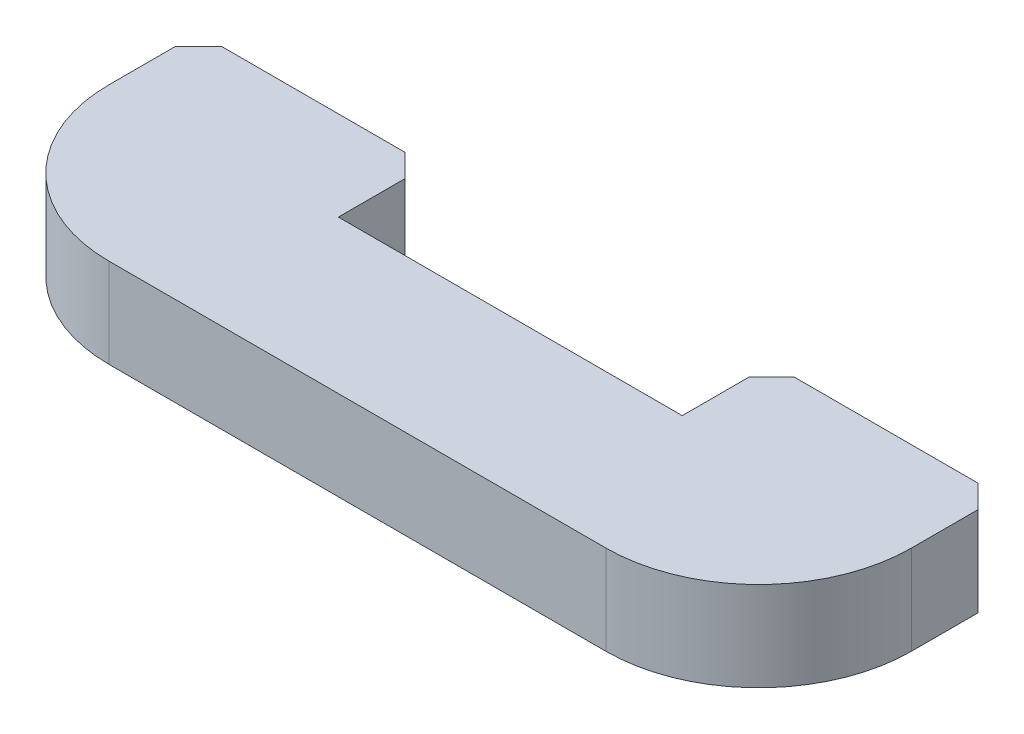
from build123d import *

# Parameters (mm, degrees)
SKETCH1_W           = 26.67
SKETCH1_H           = 8.0518
BOSS_EXTRUDE1_DEPTH = 2.9718
SKETCH2_W           = 11.43
SKETCH2_H           = 5.9436
CUT_EXTRUDE1_DEPTH  = 15.242952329
CHAMFER1_SIZE       = 0.762
FILLET1_R           = 5.08


with BuildPart() as part:
    # Sketch1 → Boss-Extrude1 (new body)
    with BuildSketch(Plane(origin=(0, 0, 0), x_dir=(1, 0, 0), z_dir=(0, 1, 0))):
        Rectangle(SKETCH1_W, SKETCH1_H)
    extrude(amount=BOSS_EXTRUDE1_DEPTH)

    # Sketch2 → Cut-Extrude1 (cut, through all)
    with BuildSketch(Plane(origin=(0, 2.9718, 0), x_dir=(1, 0, 0), z_dir=(0, 1, 0))):
        with Locations((0, 4.0259)):
            Rectangle(SKETCH2_W, SKETCH2_H)
    extrude(amount=-CUT_EXTRUDE1_DEPTH, mode=Mode.SUBTRACT)

    # Chamfer1
    chamfer1_edges = [part.edges().sort_by_distance(p)[0] for p in [
        (5.715, 1.4859, -4.0259),
        (-5.715, 1.4859, -4.0259),
        (-13.335, 1.4859, -4.0259),
        (13.335, 1.4859, -4.0259),
    ]]
    chamfer(chamfer1_edges, length=CHAMFER1_SIZE)

    # Fillet1
    fillet1_edges = [part.edges().sort_by_distance(p)[0] for p in [
        (13.335, 1.4859, 4.0259),
        (-13.335, 1.4859, 4.0259),
    ]]
    fillet(fillet1_edges, radius=FILLET1_R)


solid = part.part
